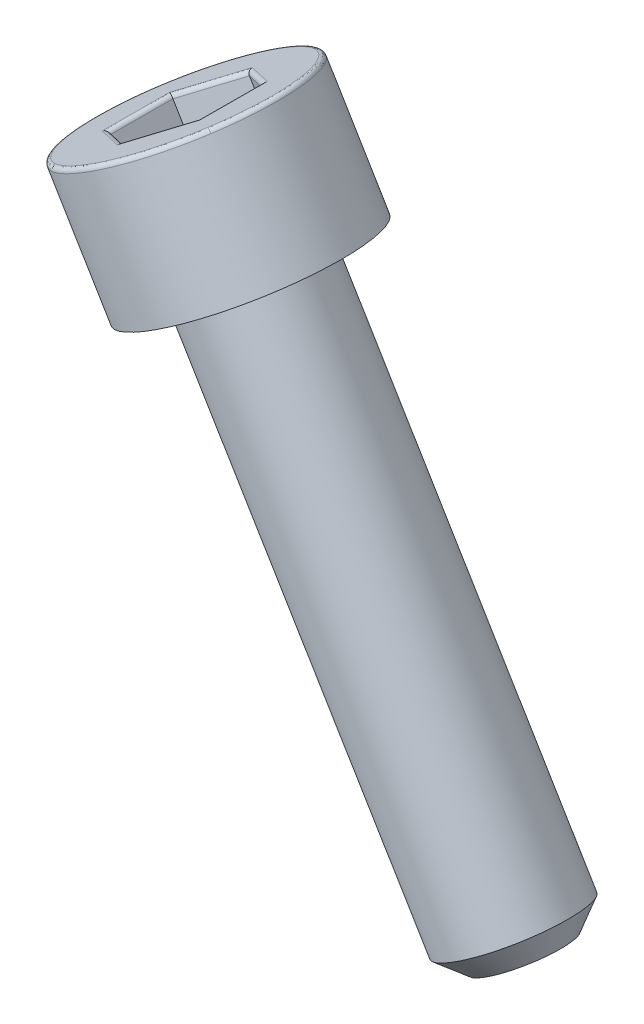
ISO-10303-21;
HEADER;
FILE_DESCRIPTION(('STEP AP214'),'2;1');
FILE_NAME('part.step','',(''),(''),'','','');
FILE_SCHEMA(('AUTOMOTIVE_DESIGN { 1 0 10303 214 1 1 1 1 }'));
ENDSEC;
DATA;
#1=APPLICATION_CONTEXT('core data for automotive mechanical design processes');
#2=APPLICATION_PROTOCOL_DEFINITION('international standard','automotive_design',2000,#1);
#3=PRODUCT_CONTEXT('',#1,'mechanical');
#4=PRODUCT('Part','Part','',(#3));
#5=PRODUCT_RELATED_PRODUCT_CATEGORY('part','',(#4));
#6=PRODUCT_DEFINITION_FORMATION('','',#4);
#7=PRODUCT_DEFINITION_CONTEXT('part definition',#1,'design');
#8=PRODUCT_DEFINITION('design','',#6,#7);
#9=PRODUCT_DEFINITION_SHAPE('','',#8);
#10=(LENGTH_UNIT() NAMED_UNIT(*) SI_UNIT(.MILLI.,.METRE.));
#11=(NAMED_UNIT(*) PLANE_ANGLE_UNIT() SI_UNIT($,.RADIAN.));
#12=(NAMED_UNIT(*) SI_UNIT($,.STERADIAN.) SOLID_ANGLE_UNIT());
#13=UNCERTAINTY_MEASURE_WITH_UNIT(LENGTH_MEASURE(1.E-05),#10,'distance_accuracy_value','');
#14=(GEOMETRIC_REPRESENTATION_CONTEXT(3) GLOBAL_UNCERTAINTY_ASSIGNED_CONTEXT((#13)) GLOBAL_UNIT_ASSIGNED_CONTEXT((#10,
#11,#12)) REPRESENTATION_CONTEXT('',''));
#15=CARTESIAN_POINT('',(0.,0.,0.));
#16=DIRECTION('',(0.,0.,1.));
#17=DIRECTION('',(1.,0.,0.));
#18=AXIS2_PLACEMENT_3D('',#15,#16,#17);
#19=CARTESIAN_POINT('',(15.734762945,26.402869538,25.091593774));
#20=DIRECTION('',(0.515913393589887,-0.856640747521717,-3.45953945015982E-11));
#21=DIRECTION('',(0.73678980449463,0.443732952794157,0.510139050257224));
#22=AXIS2_PLACEMENT_3D('',#19,#20,#21);
#23=PLANE('',#22);
#24=DIRECTION('',(-0.0100633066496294,-0.00606064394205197,0.999930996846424));
#25=VECTOR('',#24,1.);
#26=CARTESIAN_POINT('',(18.941778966,28.334300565,28.7796565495));
#27=LINE('',#26,#25);
#28=CARTESIAN_POINT('',(18.956446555,28.343134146,27.322225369));
#29=VERTEX_POINT('',#28);
#30=CARTESIAN_POINT('',(18.9271113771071,28.3254669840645,30.2370877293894));
#31=VERTEX_POINT('',#30);
#32=EDGE_CURVE('E124',#29,#31,#27,.T.);
#33=ORIENTED_EDGE('',*,*,#32,.F.);
#34=DIRECTION('',(0.736789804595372,0.443732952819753,0.510139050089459));
#35=VECTOR('',#34,1.);
#36=CARTESIAN_POINT('',(17.882552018,27.6963792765,26.578681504));
#37=LINE('',#36,#35);
#38=CARTESIAN_POINT('',(16.808657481,27.049624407,25.835137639));
#39=VERTEX_POINT('',#38);
#40=EDGE_CURVE('E155',#39,#29,#37,.T.);
#41=ORIENTED_EDGE('',*,*,#40,.F.);
#42=DIRECTION('',(0.746853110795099,0.449793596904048,-0.489791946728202));
#43=VECTOR('',#42,1.);
#44=CARTESIAN_POINT('',(15.720095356,26.3940359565,26.5490249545));
#45=LINE('',#44,#43);
#46=CARTESIAN_POINT('',(14.631533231,25.738447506,27.26291227));
#47=VERTEX_POINT('',#46);
#48=EDGE_CURVE('E143',#47,#39,#45,.T.);
#49=ORIENTED_EDGE('',*,*,#48,.F.);
#50=DIRECTION('',(0.0100633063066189,0.0060606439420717,-0.999930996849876));
#51=VECTOR('',#50,1.);
#52=CARTESIAN_POINT('',(14.6168656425,25.729613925,28.7203434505));
#53=LINE('',#52,#51);
#54=CARTESIAN_POINT('',(14.602198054,25.720780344,30.177774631));
#55=VERTEX_POINT('',#54);
#56=EDGE_CURVE('E144',#55,#47,#53,.T.);
#57=ORIENTED_EDGE('',*,*,#56,.F.);
#58=DIRECTION('',(-0.736789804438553,-0.443732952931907,-0.510139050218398));
#59=VECTOR('',#58,1.);
#60=CARTESIAN_POINT('',(15.6760925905,26.3675352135,30.921318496));
#61=LINE('',#60,#59);
#62=CARTESIAN_POINT('',(16.749987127,27.014290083,31.664862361));
#63=VERTEX_POINT('',#62);
#64=EDGE_CURVE('E105',#63,#55,#61,.T.);
#65=ORIENTED_EDGE('',*,*,#64,.F.);
#66=DIRECTION('',(-0.746853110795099,-0.449793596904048,0.489791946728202));
#67=VECTOR('',#66,1.);
#68=CARTESIAN_POINT('',(17.838549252,27.6698785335,30.9509750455));
#69=LINE('',#68,#67);
#70=EDGE_CURVE('E102',#31,#63,#69,.T.);
#71=ORIENTED_EDGE('',*,*,#70,.F.);
#72=EDGE_LOOP('',(#33,#41,#49,#57,#65,#71));
#73=FACE_BOUND('',#72,.T.);
#74=ADVANCED_FACE('F16',(#73),#23,.F.);
#75=CARTESIAN_POINT('',(18.927111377,28.325466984,30.23708773));
#76=DIRECTION('',(-0.419575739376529,-0.25269022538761,-0.871839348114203));
#77=DIRECTION('',(-0.746853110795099,-0.449793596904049,0.489791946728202));
#78=AXIS2_PLACEMENT_3D('',#75,#76,#77);
#79=PLANE('',#78);
#80=DIRECTION('',(-0.515913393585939,0.856640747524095,0.));
#81=VECTOR('',#80,1.);
#82=CARTESIAN_POINT('',(18.204832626,29.5247640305,30.23708773));
#83=LINE('',#82,#81);
#84=CARTESIAN_POINT('',(17.4825538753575,30.7240610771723,30.2370877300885));
#85=VERTEX_POINT('',#84);
#86=EDGE_CURVE('E157',#31,#85,#83,.T.);
#87=ORIENTED_EDGE('',*,*,#86,.F.);
#88=ORIENTED_EDGE('',*,*,#70,.T.);
#89=DIRECTION('',(0.51591339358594,-0.856640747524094,0.));
#90=VECTOR('',#89,1.);
#91=CARTESIAN_POINT('',(16.027708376,28.2135871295,31.664862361));
#92=LINE('',#91,#90);
#93=CARTESIAN_POINT('',(15.3054296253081,29.4128841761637,31.664862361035));
#94=VERTEX_POINT('',#93);
#95=EDGE_CURVE('E95',#94,#63,#92,.T.);
#96=ORIENTED_EDGE('',*,*,#95,.F.);
#97=DIRECTION('',(-0.746853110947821,-0.449793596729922,0.489791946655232));
#98=VECTOR('',#97,1.);
#99=CARTESIAN_POINT('',(16.3939917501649,30.0684726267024,30.9509750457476));
#100=LINE('',#99,#98);
#101=EDGE_CURVE('E100',#94,#85,#100,.F.);
#102=ORIENTED_EDGE('',*,*,#101,.T.);
#103=EDGE_LOOP('',(#87,#88,#96,#102));
#104=FACE_BOUND('',#103,.T.);
#105=ADVANCED_FACE('F98',(#104),#79,.T.);
#106=CARTESIAN_POINT('',(15.305429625,29.412884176,31.664862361));
#107=DIRECTION('',(0.43700589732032,0.263187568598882,-0.860091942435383));
#108=DIRECTION('',(0.51591339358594,-0.856640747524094,0.));
#109=AXIS2_PLACEMENT_3D('',#106,#107,#108);
#110=PLANE('',#109);
#111=ORIENTED_EDGE('',*,*,#95,.T.);
#112=ORIENTED_EDGE('',*,*,#64,.T.);
#113=DIRECTION('',(0.515913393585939,-0.856640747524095,0.));
#114=VECTOR('',#113,1.);
#115=CARTESIAN_POINT('',(13.879919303,26.9200773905,30.177774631));
#116=LINE('',#115,#114);
#117=CARTESIAN_POINT('',(13.1576405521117,28.1193744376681,30.1777746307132));
#118=VERTEX_POINT('',#117);
#119=EDGE_CURVE('E111',#118,#55,#116,.T.);
#120=ORIENTED_EDGE('',*,*,#119,.F.);
#121=DIRECTION('',(-0.736789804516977,-0.443732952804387,-0.510139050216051));
#122=VECTOR('',#121,1.);
#123=CARTESIAN_POINT('',(14.2315350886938,28.7661293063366,30.9213184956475));
#124=LINE('',#123,#122);
#125=EDGE_CURVE('E108',#118,#94,#124,.F.);
#126=ORIENTED_EDGE('',*,*,#125,.T.);
#127=EDGE_LOOP('',(#111,#112,#120,#126));
#128=FACE_BOUND('',#127,.T.);
#129=ADVANCED_FACE('F109',(#128),#110,.T.);
#130=CARTESIAN_POINT('',(14.602198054,25.720780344,30.177774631));
#131=DIRECTION('',(0.856581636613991,0.515877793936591,0.0117474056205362));
#132=DIRECTION('',(0.0100633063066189,0.0060606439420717,-0.999930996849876));
#133=AXIS2_PLACEMENT_3D('',#130,#131,#132);
#134=PLANE('',#133);
#135=ORIENTED_EDGE('',*,*,#119,.T.);
#136=ORIENTED_EDGE('',*,*,#56,.T.);
#137=DIRECTION('',(0.515913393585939,-0.856640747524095,0.));
#138=VECTOR('',#137,1.);
#139=CARTESIAN_POINT('',(13.90925448,26.9377445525,27.26291227));
#140=LINE('',#139,#138);
#141=CARTESIAN_POINT('',(13.186975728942,28.1370415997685,27.2629122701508));
#142=VERTEX_POINT('',#141);
#143=EDGE_CURVE('E140',#142,#47,#140,.T.);
#144=ORIENTED_EDGE('',*,*,#143,.F.);
#145=DIRECTION('',(0.0100633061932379,0.00606064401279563,-0.999930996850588));
#146=VECTOR('',#145,1.);
#147=CARTESIAN_POINT('',(13.1723081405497,28.1282080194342,28.7203434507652));
#148=LINE('',#147,#146);
#149=EDGE_CURVE('E130',#142,#118,#148,.F.);
#150=ORIENTED_EDGE('',*,*,#149,.T.);
#151=EDGE_LOOP('',(#135,#136,#144,#150));
#152=FACE_BOUND('',#151,.T.);
#153=ADVANCED_FACE('F365',(#152),#134,.T.);
#154=CARTESIAN_POINT('',(14.631533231,25.738447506,27.26291227));
#155=DIRECTION('',(0.419575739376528,0.25269022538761,0.871839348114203));
#156=DIRECTION('',(0.746853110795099,0.449793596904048,-0.489791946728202));
#157=AXIS2_PLACEMENT_3D('',#154,#155,#156);
#158=PLANE('',#157);
#159=ORIENTED_EDGE('',*,*,#143,.T.);
#160=ORIENTED_EDGE('',*,*,#48,.T.);
#161=DIRECTION('',(0.515913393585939,-0.856640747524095,0.));
#162=VECTOR('',#161,1.);
#163=CARTESIAN_POINT('',(16.08637873,28.2489214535,25.835137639));
#164=LINE('',#163,#162);
#165=CARTESIAN_POINT('',(15.3640999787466,29.4482185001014,25.8351376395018));
#166=VERTEX_POINT('',#165);
#167=EDGE_CURVE('E158',#166,#39,#164,.T.);
#168=ORIENTED_EDGE('',*,*,#167,.F.);
#169=DIRECTION('',(0.746853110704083,0.449793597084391,-0.489791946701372));
#170=VECTOR('',#169,1.);
#171=CARTESIAN_POINT('',(14.2755378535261,28.7926300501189,26.5490249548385));
#172=LINE('',#171,#170);
#173=EDGE_CURVE('E135',#166,#142,#172,.F.);
#174=ORIENTED_EDGE('',*,*,#173,.T.);
#175=EDGE_LOOP('',(#159,#160,#168,#174));
#176=FACE_BOUND('',#175,.T.);
#177=ADVANCED_FACE('F254',(#176),#158,.T.);
#178=CARTESIAN_POINT('',(16.808657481,27.049624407,25.835137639));
#179=DIRECTION('',(-0.437005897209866,-0.26318756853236,0.86009194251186));
#180=DIRECTION('',(0.736789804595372,0.443732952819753,0.510139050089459));
#181=AXIS2_PLACEMENT_3D('',#178,#179,#180);
#182=PLANE('',#181);
#183=ORIENTED_EDGE('',*,*,#167,.T.);
#184=ORIENTED_EDGE('',*,*,#40,.T.);
#185=DIRECTION('',(0.515913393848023,-0.856640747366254,0.));
#186=VECTOR('',#185,1.);
#187=CARTESIAN_POINT('',(18.2341678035,29.5424311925,27.322225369));
#188=LINE('',#187,#186);
#189=CARTESIAN_POINT('',(17.5118890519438,30.7417282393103,27.32222536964));
#190=VERTEX_POINT('',#189);
#191=EDGE_CURVE('E163',#190,#29,#188,.T.);
#192=ORIENTED_EDGE('',*,*,#191,.F.);
#193=DIRECTION('',(0.736789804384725,0.443732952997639,0.510139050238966));
#194=VECTOR('',#193,1.);
#195=CARTESIAN_POINT('',(16.437994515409,30.0949733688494,26.5786815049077));
#196=LINE('',#195,#194);
#197=EDGE_CURVE('E235',#190,#166,#196,.F.);
#198=ORIENTED_EDGE('',*,*,#197,.T.);
#199=EDGE_LOOP('',(#183,#184,#192,#198));
#200=FACE_BOUND('',#199,.T.);
#201=ADVANCED_FACE('F250',(#200),#182,.T.);
#202=CARTESIAN_POINT('',(18.956446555,28.343134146,27.322225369));
#203=DIRECTION('',(-0.856581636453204,-0.515877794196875,-0.0117474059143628));
#204=DIRECTION('',(-0.0100633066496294,-0.00606064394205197,0.999930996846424));
#205=AXIS2_PLACEMENT_3D('',#202,#203,#204);
#206=PLANE('',#205);
#207=ORIENTED_EDGE('',*,*,#191,.T.);
#208=ORIENTED_EDGE('',*,*,#32,.T.);
#209=ORIENTED_EDGE('',*,*,#86,.T.);
#210=DIRECTION('',(-0.0100633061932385,-0.00606064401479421,0.999930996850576));
#211=VECTOR('',#210,1.);
#212=CARTESIAN_POINT('',(17.4972214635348,30.7328946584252,28.7796565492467));
#213=LINE('',#212,#211);
#214=EDGE_CURVE('E231',#85,#190,#213,.F.);
#215=ORIENTED_EDGE('',*,*,#214,.T.);
#216=EDGE_LOOP('',(#207,#208,#209,#215));
#217=FACE_BOUND('',#216,.T.);
#218=ADVANCED_FACE('F200',(#217),#206,.T.);
#219=CARTESIAN_POINT('',(17.6668058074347,30.8350271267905,30.345653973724));
#220=DIRECTION('',(-0.746853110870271,-0.449793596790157,0.489791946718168));
#221=DIRECTION('',(0.548397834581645,0.,0.836217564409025));
#222=AXIS2_PLACEMENT_3D('',#219,#220,#221);
#223=CYLINDRICAL_SURFACE('',#222,0.199999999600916);
#224=ORIENTED_EDGE('',*,*,#101,.F.);
#225=CARTESIAN_POINT('',(15.3031056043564,29.4114845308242,31.8957865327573));
#226=DIRECTION('',(-0.856581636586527,-0.515877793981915,-0.0117474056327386));
#227=DIRECTION('',(0.010063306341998,0.00606064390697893,-0.999930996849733));
#228=AXIS2_PLACEMENT_3D('',#225,#226,#227);
#229=ELLIPSE('',#228,0.230940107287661,0.199999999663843);
#230=CARTESIAN_POINT('',(15.1999229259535,29.5828126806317,31.8957865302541));
#231=VERTEX_POINT('',#230);
#232=EDGE_CURVE('E20',#94,#231,#229,.F.);
#233=ORIENTED_EDGE('',*,*,#232,.T.);
#234=DIRECTION('',(-0.746853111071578,-0.449793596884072,0.489791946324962));
#235=VECTOR('',#234,1.);
#236=CARTESIAN_POINT('',(17.5495255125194,30.9978649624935,30.3548992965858));
#237=LINE('',#236,#235);
#238=CARTESIAN_POINT('',(17.5495255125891,30.9978649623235,30.3548992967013));
#239=VERTEX_POINT('',#238);
#240=EDGE_CURVE('E149',#239,#231,#237,.T.);
#241=ORIENTED_EDGE('',*,*,#240,.F.);
#242=CARTESIAN_POINT('',(17.6527081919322,30.8265368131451,30.3548992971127));
#243=DIRECTION('',(-0.437005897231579,-0.263187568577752,0.860091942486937));
#244=DIRECTION('',(-0.736789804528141,-0.443732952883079,-0.510139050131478));
#245=AXIS2_PLACEMENT_3D('',#242,#243,#244);
#246=ELLIPSE('',#245,0.230940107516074,0.199999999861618);
#247=EDGE_CURVE('E122',#239,#85,#246,.T.);
#248=ORIENTED_EDGE('',*,*,#247,.T.);
#249=EDGE_LOOP('',(#224,#233,#241,#248));
#250=FACE_BOUND('',#249,.T.);
#251=ADVANCED_FACE('F119',(#250),#223,.T.);
#252=CARTESIAN_POINT('',(15.3170132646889,29.4198604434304,31.9054159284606));
#253=DIRECTION('',(-0.736789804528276,-0.44373295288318,-0.510139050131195));
#254=DIRECTION('',(-0.56925056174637,0.,0.822164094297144));
#255=AXIS2_PLACEMENT_3D('',#252,#253,#254);
#256=CYLINDRICAL_SURFACE('',#255,0.19999999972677);
#257=ORIENTED_EDGE('',*,*,#125,.F.);
#258=CARTESIAN_POINT('',(12.9851622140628,28.0154990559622,30.2908872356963));
#259=DIRECTION('',(-0.419575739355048,-0.2526902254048,-0.871839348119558));
#260=DIRECTION('',(0.746853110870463,0.449793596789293,-0.489791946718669));
#261=AXIS2_PLACEMENT_3D('',#258,#259,#260);
#262=ELLIPSE('',#261,0.230940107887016,0.200000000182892);
#263=CARTESIAN_POINT('',(12.8819795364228,28.1868272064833,30.2908872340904));
#264=VERTEX_POINT('',#263);
#265=EDGE_CURVE('E131',#118,#264,#262,.F.);
#266=ORIENTED_EDGE('',*,*,#265,.T.);
#267=DIRECTION('',(-0.736789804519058,-0.443732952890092,-0.510139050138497));
#268=VECTOR('',#267,1.);
#269=CARTESIAN_POINT('',(14.0409512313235,28.884819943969,31.0933368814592));
#270=LINE('',#269,#268);
#271=EDGE_CURVE('E128',#231,#264,#270,.T.);
#272=ORIENTED_EDGE('',*,*,#271,.F.);
#273=ORIENTED_EDGE('',*,*,#232,.F.);
#274=EDGE_LOOP('',(#257,#266,#272,#273));
#275=FACE_BOUND('',#274,.T.);
#276=ADVANCED_FACE('F126',(#275),#256,.T.);
#277=CARTESIAN_POINT('',(12.9849722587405,28.0153846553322,30.309761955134));
#278=DIRECTION('',(0.0100633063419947,0.00606064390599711,-0.999930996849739));
#279=DIRECTION('',(-0.999949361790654,0.,-0.0100634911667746));
#280=AXIS2_PLACEMENT_3D('',#277,#278,#279);
#281=CYLINDRICAL_SURFACE('',#280,0.200000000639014);
#282=DIRECTION('',(0.0100633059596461,0.00606064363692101,-0.999930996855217));
#283=VECTOR('',#282,1.);
#284=CARTESIAN_POINT('',(12.8819795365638,28.1868272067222,30.2908872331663));
#285=LINE('',#284,#283);
#286=CARTESIAN_POINT('',(12.9136387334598,28.2058940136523,27.1451007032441));
#287=VERTEX_POINT('',#286);
#288=EDGE_CURVE('E148',#264,#287,#285,.T.);
#289=ORIENTED_EDGE('',*,*,#288,.F.);
#290=ORIENTED_EDGE('',*,*,#265,.F.);
#291=ORIENTED_EDGE('',*,*,#149,.F.);
#292=CARTESIAN_POINT('',(13.0168214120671,28.0345658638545,27.1451007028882));
#293=DIRECTION('',(0.4370058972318,0.263187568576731,-0.860091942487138));
#294=DIRECTION('',(0.736789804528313,0.443732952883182,0.51013905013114));
#295=AXIS2_PLACEMENT_3D('',#292,#293,#294);
#296=ELLIPSE('',#295,0.230940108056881,0.200000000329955);
#297=EDGE_CURVE('E236',#142,#287,#296,.F.);
#298=ORIENTED_EDGE('',*,*,#297,.T.);
#299=EDGE_LOOP('',(#289,#290,#291,#298));
#300=FACE_BOUND('',#299,.T.);
#301=ADVANCED_FACE('F380',(#300),#281,.T.);
#302=CARTESIAN_POINT('',(13.002723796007,28.0260755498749,27.1543460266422));
#303=DIRECTION('',(0.746853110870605,0.449793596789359,-0.489791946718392));
#304=DIRECTION('',(-0.548397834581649,0.,-0.836217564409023));
#305=AXIS2_PLACEMENT_3D('',#302,#303,#304);
#306=CYLINDRICAL_SURFACE('',#305,0.200000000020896);
#307=DIRECTION('',(0.746853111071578,0.449793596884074,-0.48979194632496));
#308=VECTOR('',#307,1.);
#309=CARTESIAN_POINT('',(12.9136387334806,28.2058940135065,27.1451007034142));
#310=LINE('',#309,#308);
#311=CARTESIAN_POINT('',(15.263241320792,29.6209462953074,25.6042134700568));
#312=VERTEX_POINT('',#311);
#313=EDGE_CURVE('E223',#287,#312,#310,.T.);
#314=ORIENTED_EDGE('',*,*,#313,.F.);
#315=ORIENTED_EDGE('',*,*,#297,.F.);
#316=ORIENTED_EDGE('',*,*,#173,.F.);
#317=CARTESIAN_POINT('',(15.3664239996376,29.4496181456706,25.6042134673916));
#318=DIRECTION('',(0.856581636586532,0.515877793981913,0.0117474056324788));
#319=DIRECTION('',(-0.0100633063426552,-0.0060606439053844,0.999930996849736));
#320=AXIS2_PLACEMENT_3D('',#317,#318,#319);
#321=ELLIPSE('',#320,0.230940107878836,0.200000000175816);
#322=EDGE_CURVE('E233',#166,#312,#321,.F.);
#323=ORIENTED_EDGE('',*,*,#322,.T.);
#324=EDGE_LOOP('',(#314,#315,#316,#323));
#325=FACE_BOUND('',#324,.T.);
#326=ADVANCED_FACE('F385',(#325),#306,.T.);
#327=CARTESIAN_POINT('',(15.3525163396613,29.4412422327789,25.5945840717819));
#328=DIRECTION('',(0.736789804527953,0.443732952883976,0.510139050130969));
#329=DIRECTION('',(0.569250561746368,0.,-0.822164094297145));
#330=AXIS2_PLACEMENT_3D('',#327,#328,#329);
#331=CYLINDRICAL_SURFACE('',#330,0.200000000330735);
#332=ORIENTED_EDGE('',*,*,#197,.F.);
#333=CARTESIAN_POINT('',(17.6843673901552,30.8456036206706,27.2091127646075));
#334=DIRECTION('',(0.419575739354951,0.252690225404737,0.871839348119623));
#335=DIRECTION('',(-0.746853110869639,-0.449793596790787,0.489791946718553));
#336=AXIS2_PLACEMENT_3D('',#333,#334,#335);
#337=ELLIPSE('',#336,0.230940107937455,0.200000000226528);
#338=CARTESIAN_POINT('',(17.5811847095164,31.0169317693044,27.2091127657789));
#339=VERTEX_POINT('',#338);
#340=EDGE_CURVE('E229',#190,#339,#337,.F.);
#341=ORIENTED_EDGE('',*,*,#340,.T.);
#342=DIRECTION('',(0.736789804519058,0.443732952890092,0.510139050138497));
#343=VECTOR('',#342,1.);
#344=CARTESIAN_POINT('',(16.4222130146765,30.318939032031,26.4066631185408));
#345=LINE('',#344,#343);
#346=EDGE_CURVE('E222',#312,#339,#345,.T.);
#347=ORIENTED_EDGE('',*,*,#346,.F.);
#348=ORIENTED_EDGE('',*,*,#322,.F.);
#349=EDGE_LOOP('',(#332,#341,#347,#348));
#350=FACE_BOUND('',#349,.T.);
#351=ADVANCED_FACE('F387',(#350),#331,.T.);
#352=CARTESIAN_POINT('',(17.6845573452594,30.8457180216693,27.190238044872));
#353=DIRECTION('',(-0.010063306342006,-0.00606064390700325,0.999930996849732));
#354=DIRECTION('',(0.999949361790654,0.,0.0100634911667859));
#355=AXIS2_PLACEMENT_3D('',#352,#353,#354);
#356=CYLINDRICAL_SURFACE('',#355,0.20000000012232);
#357=ORIENTED_EDGE('',*,*,#214,.F.);
#358=ORIENTED_EDGE('',*,*,#247,.F.);
#359=DIRECTION('',(-0.0100633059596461,-0.00606064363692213,0.999930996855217));
#360=VECTOR('',#359,1.);
#361=CARTESIAN_POINT('',(17.5811847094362,31.0169317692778,27.2091127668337));
#362=LINE('',#361,#360);
#363=EDGE_CURVE('E219',#339,#239,#362,.T.);
#364=ORIENTED_EDGE('',*,*,#363,.F.);
#365=ORIENTED_EDGE('',*,*,#340,.F.);
#366=EDGE_LOOP('',(#357,#358,#364,#365));
#367=FACE_BOUND('',#366,.T.);
#368=ADVANCED_FACE('F198',(#367),#356,.T.);
#369=CARTESIAN_POINT('',(20.933412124,33.035816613,27.05006883));
#370=DIRECTION('',(-0.515913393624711,0.856640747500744,-3.32595744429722E-11));
#371=DIRECTION('',(-0.736789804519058,-0.443732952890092,-0.510139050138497));
#372=AXIS2_PLACEMENT_3D('',#369,#370,#371);
#373=PLANE('',#372);
#374=ORIENTED_EDGE('',*,*,#346,.T.);
#375=ORIENTED_EDGE('',*,*,#363,.T.);
#376=ORIENTED_EDGE('',*,*,#240,.T.);
#377=ORIENTED_EDGE('',*,*,#271,.T.);
#378=ORIENTED_EDGE('',*,*,#288,.T.);
#379=ORIENTED_EDGE('',*,*,#313,.T.);
#380=EDGE_LOOP('',(#374,#375,#376,#377,#378,#379));
#381=FACE_BOUND('',#380,.T.);
#382=CARTESIAN_POINT('',(18.768173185,31.731797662,31.198667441));
#383=CARTESIAN_POINT('',(14.572916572,29.205197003,39.455550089));
#384=CARTESIAN_POINT('',(7.499734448,24.945360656,34.558215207));
#385=CARTESIAN_POINT('',(11.694991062,27.471961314,26.301332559));
#386=(BOUNDED_CURVE() B_SPLINE_CURVE(3,(#382,#383,#384,#385),.UNSPECIFIED.,.F.,
.F.) B_SPLINE_CURVE_WITH_KNOTS((4,4),(0.,1.),
.UNSPECIFIED.) CURVE() GEOMETRIC_REPRESENTATION_ITEM() RATIONAL_B_SPLINE_CURVE((1.,
0.333333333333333,0.333333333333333,1.)) REPRESENTATION_ITEM(''));
#387=CARTESIAN_POINT('',(18.7681731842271,31.7317976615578,31.1986674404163));
#388=VERTEX_POINT('',#387);
#389=CARTESIAN_POINT('',(11.6949910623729,27.4719613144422,26.3013325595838));
#390=VERTEX_POINT('',#389);
#391=EDGE_CURVE('E181',#388,#390,#386,.T.);
#392=ORIENTED_EDGE('',*,*,#391,.F.);
#393=CARTESIAN_POINT('',(11.6949910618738,27.471961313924,26.3013325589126));
#394=CARTESIAN_POINT('',(15.8902476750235,29.9985619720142,18.0444499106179));
#395=CARTESIAN_POINT('',(22.963429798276,34.2583983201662,22.9417847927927));
#396=CARTESIAN_POINT('',(18.7681731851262,31.7317976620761,31.1986674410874));
#397=(BOUNDED_CURVE() B_SPLINE_CURVE(3,(#393,#394,#395,#396),.UNSPECIFIED.,.F.,
.F.) B_SPLINE_CURVE_WITH_KNOTS((4,4),(0.,1.),
.UNSPECIFIED.) CURVE() GEOMETRIC_REPRESENTATION_ITEM() RATIONAL_B_SPLINE_CURVE((0.999999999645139,
0.333333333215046,0.333333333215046,0.999999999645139)) REPRESENTATION_ITEM(''));
#398=EDGE_CURVE('E318',#390,#388,#397,.T.);
#399=ORIENTED_EDGE('',*,*,#398,.F.);
#400=EDGE_LOOP('',(#392,#399));
#401=FACE_BOUND('',#400,.T.);
#402=ADVANCED_FACE('F188',(#381,#401),#373,.T.);
#403=CARTESIAN_POINT('',(11.694991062,27.471961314,26.301332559));
#404=CARTESIAN_POINT('',(7.499734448,24.945360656,34.558215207));
#405=CARTESIAN_POINT('',(14.572916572,29.205197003,39.455550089));
#406=CARTESIAN_POINT('',(18.768173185,31.731797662,31.198667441));
#407=CARTESIAN_POINT('',(11.608670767,27.419974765,26.241566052));
#408=CARTESIAN_POINT('',(7.311017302,24.831705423,34.699980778));
#409=CARTESIAN_POINT('',(14.556840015,29.195514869,39.716848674));
#410=CARTESIAN_POINT('',(18.85449348,31.783784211,31.258433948));
#411=CARTESIAN_POINT('',(11.590372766,27.31224828,26.199304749));
#412=CARTESIAN_POINT('',(7.220313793,24.680372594,34.800224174));
#413=CARTESIAN_POINT('',(14.588211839,29.117702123,39.901614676));
#414=CARTESIAN_POINT('',(18.958270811,31.749577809,31.300695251));
#415=CARTESIAN_POINT('',(11.650815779,27.211886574,26.199304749));
#416=CARTESIAN_POINT('',(7.280756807,24.580010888,34.800224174));
#417=CARTESIAN_POINT('',(14.648654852,29.017340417,39.901614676));
#418=CARTESIAN_POINT('',(19.018713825,31.649216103,31.300695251));
#419=(BOUNDED_SURFACE() B_SPLINE_SURFACE(3,3,((#403,#404,#405,#406),(#407,#408,#409,#410),(#411,
#412,#413,#414),(#415,#416,#417,#418)),.UNSPECIFIED.,.F.,.F.,
.F.) B_SPLINE_SURFACE_WITH_KNOTS((4,4),(4,4),(0.,1.),(0.,1.),
.UNSPECIFIED.) GEOMETRIC_REPRESENTATION_ITEM() RATIONAL_B_SPLINE_SURFACE(((1.,0.333333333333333,
0.333333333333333,1.),(0.804737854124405,0.268245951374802,0.268245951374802,0.804737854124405),
(0.804737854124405,0.268245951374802,0.268245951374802,0.804737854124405),(1.,0.333333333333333,
0.333333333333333,1.))) REPRESENTATION_ITEM('') SURFACE());
#420=CARTESIAN_POINT('',(11.694991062,27.471961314,26.301332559));
#421=CARTESIAN_POINT('',(11.608670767,27.419974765,26.241566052));
#422=CARTESIAN_POINT('',(11.590372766,27.31224828,26.199304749));
#423=CARTESIAN_POINT('',(11.650815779,27.211886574,26.199304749));
#424=(BOUNDED_CURVE() B_SPLINE_CURVE(3,(#420,#421,#422,#423),.UNSPECIFIED.,.F.,
.F.) B_SPLINE_CURVE_WITH_KNOTS((4,4),(0.,1.),
.UNSPECIFIED.) CURVE() GEOMETRIC_REPRESENTATION_ITEM() RATIONAL_B_SPLINE_CURVE((1.,
0.804737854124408,0.804737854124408,1.)) REPRESENTATION_ITEM(''));
#425=CARTESIAN_POINT('',(11.6508157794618,27.2118865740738,26.1993047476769));
#426=VERTEX_POINT('',#425);
#427=EDGE_CURVE('E35',#426,#390,#424,.F.);
#428=CARTESIAN_POINT('',(15.3347648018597,29.4305513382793,28.75));
#429=DIRECTION('',(0.515913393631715,-0.856640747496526,0.));
#430=DIRECTION('',(0.7367898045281,0.44373295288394,0.510139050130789));
#431=AXIS2_PLACEMENT_3D('',#428,#429,#430);
#432=CIRCLE('',#431,5.00000000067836);
#433=CARTESIAN_POINT('',(19.0187138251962,31.6492161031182,31.3006952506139));
#434=VERTEX_POINT('',#433);
#435=EDGE_CURVE('E339',#426,#434,#432,.F.);
#436=CARTESIAN_POINT('',(18.768173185,31.731797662,31.198667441));
#437=CARTESIAN_POINT('',(18.85449348,31.783784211,31.258433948));
#438=CARTESIAN_POINT('',(18.958270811,31.749577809,31.300695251));
#439=CARTESIAN_POINT('',(19.018713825,31.649216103,31.300695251));
#440=(BOUNDED_CURVE() B_SPLINE_CURVE(3,(#436,#437,#438,#439),.UNSPECIFIED.,.F.,
.F.) B_SPLINE_CURVE_WITH_KNOTS((4,4),(0.,1.),
.UNSPECIFIED.) CURVE() GEOMETRIC_REPRESENTATION_ITEM() RATIONAL_B_SPLINE_CURVE((1.,
0.804737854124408,0.804737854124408,1.)) REPRESENTATION_ITEM(''));
#441=EDGE_CURVE('E323',#388,#434,#440,.T.);
#442=ORIENTED_EDGE('',*,*,#391,.T.);
#443=ORIENTED_EDGE('',*,*,#427,.F.);
#444=ORIENTED_EDGE('',*,*,#435,.T.);
#445=ORIENTED_EDGE('',*,*,#441,.F.);
#446=EDGE_LOOP('',(#442,#443,#444,#445));
#447=FACE_BOUND('',#446,.T.);
#448=ADVANCED_FACE('F197',(#447),#419,.T.);
#449=CARTESIAN_POINT('',(18.768173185,31.731797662,31.198667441));
#450=CARTESIAN_POINT('',(22.963429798,34.25839832,22.941784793));
#451=CARTESIAN_POINT('',(15.890247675,29.998561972,18.044449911));
#452=CARTESIAN_POINT('',(11.694991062,27.471961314,26.301332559));
#453=CARTESIAN_POINT('',(18.85449348,31.783784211,31.258433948));
#454=CARTESIAN_POINT('',(23.152146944,34.372053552,22.800019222));
#455=CARTESIAN_POINT('',(15.906324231,30.008244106,17.783151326));
#456=CARTESIAN_POINT('',(11.608670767,27.419974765,26.241566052));
#457=CARTESIAN_POINT('',(18.958270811,31.749577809,31.300695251));
#458=CARTESIAN_POINT('',(23.328329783,34.381453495,22.699775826));
#459=CARTESIAN_POINT('',(15.960431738,29.944123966,17.598385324));
#460=CARTESIAN_POINT('',(11.590372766,27.31224828,26.199304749));
#461=CARTESIAN_POINT('',(19.018713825,31.649216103,31.300695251));
#462=CARTESIAN_POINT('',(23.388772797,34.281091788,22.699775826));
#463=CARTESIAN_POINT('',(16.020874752,29.84376226,17.598385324));
#464=CARTESIAN_POINT('',(11.650815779,27.211886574,26.199304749));
#465=(BOUNDED_SURFACE() B_SPLINE_SURFACE(3,3,((#449,#450,#451,#452),(#453,#454,#455,#456),(#457,
#458,#459,#460),(#461,#462,#463,#464)),.UNSPECIFIED.,.F.,.F.,
.F.) B_SPLINE_SURFACE_WITH_KNOTS((4,4),(4,4),(0.,1.),(0.,1.),
.UNSPECIFIED.) GEOMETRIC_REPRESENTATION_ITEM() RATIONAL_B_SPLINE_SURFACE(((1.,0.333333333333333,
0.333333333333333,1.),(0.804737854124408,0.268245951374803,0.268245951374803,0.804737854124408),
(0.804737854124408,0.268245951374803,0.268245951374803,0.804737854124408),(1.,0.333333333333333,
0.333333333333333,1.))) REPRESENTATION_ITEM('') SURFACE());
#466=CARTESIAN_POINT('',(15.3347648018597,29.4305513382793,28.75));
#467=DIRECTION('',(0.515913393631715,-0.856640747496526,0.));
#468=DIRECTION('',(0.7367898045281,0.44373295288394,0.510139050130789));
#469=AXIS2_PLACEMENT_3D('',#466,#467,#468);
#470=CIRCLE('',#469,5.00000000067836);
#471=EDGE_CURVE('E218',#434,#426,#470,.F.);
#472=ORIENTED_EDGE('',*,*,#427,.T.);
#473=ORIENTED_EDGE('',*,*,#398,.T.);
#474=ORIENTED_EDGE('',*,*,#441,.T.);
#475=ORIENTED_EDGE('',*,*,#471,.T.);
#476=EDGE_LOOP('',(#472,#473,#474,#475));
#477=FACE_BOUND('',#476,.T.);
#478=ADVANCED_FACE('F287',(#477),#465,.T.);
#479=CARTESIAN_POINT('',(15.3347648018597,29.4305513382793,28.75));
#480=DIRECTION('',(0.515913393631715,-0.856640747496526,0.));
#481=DIRECTION('',(0.856640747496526,0.515913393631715,0.));
#482=AXIS2_PLACEMENT_3D('',#479,#480,#481);
#483=CYLINDRICAL_SURFACE('',#482,5.00000000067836);
#484=ORIENTED_EDGE('',*,*,#471,.F.);
#485=ORIENTED_EDGE('',*,*,#435,.F.);
#486=EDGE_LOOP('',(#484,#485));
#487=FACE_BOUND('',#486,.T.);
#488=CARTESIAN_POINT('',(18.3270624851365,24.462035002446,28.75));
#489=DIRECTION('',(0.515913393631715,-0.856640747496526,0.));
#490=DIRECTION('',(0.856640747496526,0.515913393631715,0.));
#491=AXIS2_PLACEMENT_3D('',#488,#489,#490);
#492=CIRCLE('',#491,5.00000000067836);
#493=CARTESIAN_POINT('',(22.6102662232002,27.0416019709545,28.75));
#494=VERTEX_POINT('',#493);
#495=EDGE_CURVE('E215',#494,#494,#492,.F.);
#496=ORIENTED_EDGE('',*,*,#495,.T.);
#497=EDGE_LOOP('',(#496));
#498=FACE_BOUND('',#497,.T.);
#499=ADVANCED_FACE('F299',(#487,#498),#483,.T.);
#500=CARTESIAN_POINT('',(24.266468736,28.039052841,26.979238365));
#501=DIRECTION('',(-0.515913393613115,0.856640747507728,1.17215355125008E-11));
#502=DIRECTION('',(-0.736789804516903,-0.443732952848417,-0.51013905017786));
#503=AXIS2_PLACEMENT_3D('',#500,#501,#502);
#504=PLANE('',#503);
#505=CARTESIAN_POINT('',(18.3270624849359,24.4620350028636,28.75));
#506=DIRECTION('',(-0.515913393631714,0.856640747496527,0.));
#507=DIRECTION('',(-0.856640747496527,-0.515913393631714,0.));
#508=AXIS2_PLACEMENT_3D('',#505,#506,#507);
#509=CIRCLE('',#508,2.99999999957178);
#510=CARTESIAN_POINT('',(15.7571402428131,22.9142948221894,28.75));
#511=VERTEX_POINT('',#510);
#512=EDGE_CURVE('E212',#511,#511,#509,.T.);
#513=ORIENTED_EDGE('',*,*,#512,.T.);
#514=EDGE_LOOP('',(#513));
#515=FACE_BOUND('',#514,.T.);
#516=ORIENTED_EDGE('',*,*,#495,.F.);
#517=EDGE_LOOP('',(#516));
#518=FACE_BOUND('',#517,.T.);
#519=ADVANCED_FACE('F202',(#515,#518),#504,.F.);
#520=CARTESIAN_POINT('',(30.7089839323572,3.90265706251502,28.75));
#521=DIRECTION('',(-0.515913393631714,0.856640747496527,0.));
#522=DIRECTION('',(-0.856640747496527,-0.515913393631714,0.));
#523=AXIS2_PLACEMENT_3D('',#520,#521,#522);
#524=CYLINDRICAL_SURFACE('',#523,2.99999999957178);
#525=ORIENTED_EDGE('',*,*,#512,.F.);
#526=EDGE_LOOP('',(#525));
#527=FACE_BOUND('',#526,.T.);
#528=CARTESIAN_POINT('',(30.7089839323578,3.9026570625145,28.75));
#529=DIRECTION('',(-0.515913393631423,0.856640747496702,0.));
#530=DIRECTION('',(-0.73678980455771,-0.443732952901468,-0.510139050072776));
#531=AXIS2_PLACEMENT_3D('',#528,#529,#530);
#532=CIRCLE('',#531,2.99999999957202);
#533=CARTESIAN_POINT('',(28.498614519,2.571458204,27.21958285));
#534=VERTEX_POINT('',#533);
#535=EDGE_CURVE('E26',#534,#534,#532,.T.);
#536=ORIENTED_EDGE('',*,*,#535,.T.);
#537=EDGE_LOOP('',(#536));
#538=FACE_BOUND('',#537,.T.);
#539=ADVANCED_FACE('F346',(#527,#538),#524,.T.);
#540=CARTESIAN_POINT('',(30.618134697,2.680592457,25.976652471));
#541=DIRECTION('',(0.515913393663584,-0.856640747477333,1.7084782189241E-10));
#542=DIRECTION('',(0.736789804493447,0.443732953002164,0.510139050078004));
#543=AXIS2_PLACEMENT_3D('',#540,#541,#542);
#544=PLANE('',#543);
#545=CARTESIAN_POINT('',(31.2248973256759,3.04601631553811,28.75));
#546=DIRECTION('',(-0.515913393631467,0.856640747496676,0.));
#547=DIRECTION('',(-0.856640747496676,-0.515913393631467,0.));
#548=AXIS2_PLACEMENT_3D('',#545,#546,#547);
#549=CIRCLE('',#548,1.99999999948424);
#550=CARTESIAN_POINT('',(29.5116158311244,2.01418952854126,28.75));
#551=VERTEX_POINT('',#550);
#552=EDGE_CURVE('E11',#551,#551,#549,.F.);
#553=ORIENTED_EDGE('',*,*,#552,.T.);
#554=EDGE_LOOP('',(#553));
#555=FACE_BOUND('',#554,.T.);
#556=ADVANCED_FACE('F18',(#555),#544,.T.);
#557=CARTESIAN_POINT('',(31.2248973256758,3.04601631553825,28.75));
#558=DIRECTION('',(-0.515913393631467,0.856640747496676,0.));
#559=DIRECTION('',(-0.856640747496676,-0.515913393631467,0.));
#560=AXIS2_PLACEMENT_3D('',#557,#558,#559);
#561=CONICAL_SURFACE('',#560,1.9999999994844,0.785398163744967);
#562=ORIENTED_EDGE('',*,*,#552,.F.);
#563=EDGE_LOOP('',(#562));
#564=FACE_BOUND('',#563,.T.);
#565=ORIENTED_EDGE('',*,*,#535,.F.);
#566=EDGE_LOOP('',(#565));
#567=FACE_BOUND('',#566,.T.);
#568=ADVANCED_FACE('F348',(#564,#567),#561,.T.);
#569=CLOSED_SHELL('',(#74,#105,#129,#153,#177,#201,#218,#251,#276,#301,#326,#351,#368,#402,#448,
#478,#499,#519,#539,#556,#568));
#570=MANIFOLD_SOLID_BREP('B1',#569);
#571=ADVANCED_BREP_SHAPE_REPRESENTATION('',(#18,#570),#14);
#572=SHAPE_DEFINITION_REPRESENTATION(#9,#571);
ENDSEC;
END-ISO-10303-21;
